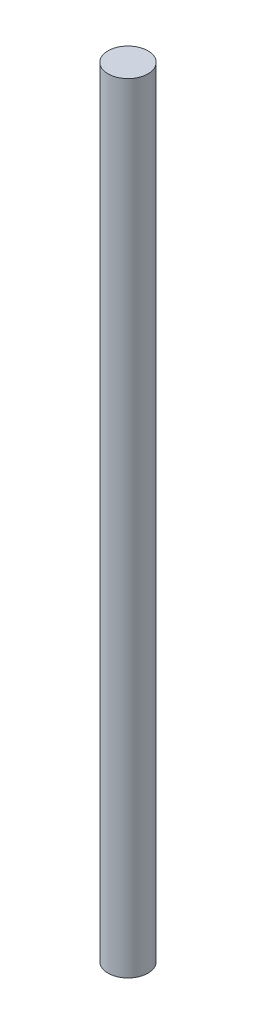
from build123d import *

# Parameters (mm, degrees)
SKETCH1_R           = 4
BOSS_EXTRUDE1_DEPTH = 156


with BuildPart() as part:
    # Sketch1 → Boss-Extrude1 (new body)
    with BuildSketch(Plane(origin=(0, 0, 0), x_dir=(1, 0, 0), z_dir=(0, 1, 0))):
        with Locations(Location((0, 0, 0), (0, 0, 270))):
            Circle(SKETCH1_R)
    extrude(amount=BOSS_EXTRUDE1_DEPTH)


solid = part.part
